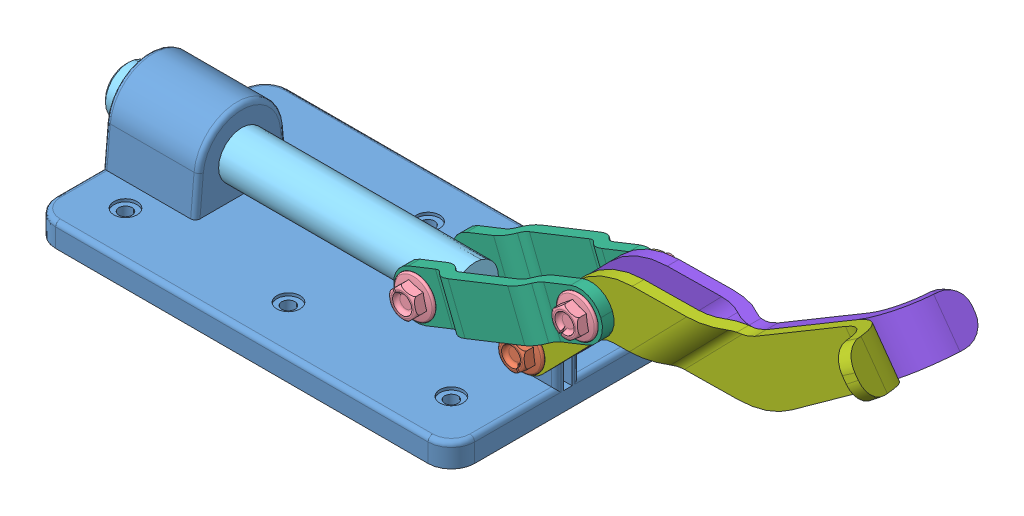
SolidWorks assembly plunger.sldasm, configuration MaxRange (file format 12000). Lengths in mm.
Overall size (219.76 113.92 63.5).
12 component instances, 8 part files, 27 mates.
Components (placement in the parent):
- base_plunger-1: base_plunger.sldprt [Default] at origin
- short bolt_plunger-1: short bolt_plunger.sldprt [Default] at (109.22 15.24 6.35) x (0.598617 -0.801035 0) z (0 0 1)
- nut_plunger-1: nut_plunger.sldprt [Default] at (109.22 15.24 -6.35) x (-0.923728 -0.383049 0) z (0 0 -1)
- long bolt_plunger-1: long bolt_plunger.sldprt [Default] at (126.9419 33.436 9.525) x (-0.358847 -0.933396 0) z (0 0 1)
- nut_plunger-2: nut_plunger.sldprt [Default] at (126.9419 33.436 -9.525) x (0.937093 -0.349079 0) z (0 0 -1)
- long bolt_plunger-2: long bolt_plunger.sldprt [Default] at (82.6728 15.875 9.525) x (-0.700643 0.713512 0) z (0 0 1)
- nut_plunger-3: nut_plunger.sldprt [Default] at (82.6728 15.875 -9.525) x (-0.077903 -0.996961 0) z (0 0 -1)
- plunger-1: plunger.sldprt [Default] at (-6.2272 15.875 0)
- link_plunger-1: link_plunger.sldprt [Default] at (104.8074 24.6555 6.35) x (0.929535 0.368734 0) z (0 0 1)
- link_plunger-2: link_plunger.sldprt [Default] at (104.8074 24.6555 -6.35) x (0.929535 0.368734 0) z (0 0 -1)
- arm left-1: arm left.sldprt [Default] at (109.22 15.24 3.175) x (-0.697714 -0.716376 0) z (0 0 1)
- arm right-1: arm right.sldprt [Default] at (109.22 15.24 -3.175) x (-0.697714 -0.716376 0) z (0 0 1)
Mates (geometry in assembly coordinates):
- Concentric1: concentric aligned: cylinder of base_plunger-1 through (109.22 15.24 3.175) axis (0 0 1) radius 2.54; cylinder of short bolt_plunger-1 through (109.22 15.24 -13.65) axis (0 0 1) radius 2
- Coincident1: coincident anti-aligned: plane of base_plunger-1 through (109.22 15.24 3.175) normal (0 0 1); plane of arm left-1 through (244.6002 5.9931 3.175) normal (0 0 -1)
- Concentric2: concentric anti-aligned: cylinder of arm right-1 through (109.22 15.24 0) axis (0 0 -1) radius 2.3813; cylinder of short bolt_plunger-1 through (109.22 15.24 -13.65) axis (0 0 1) radius 2
- Coincident2: coincident anti-aligned: plane of base_plunger-1 through (109.22 15.24 -3.175) normal (0 0 -1); plane of arm right-1 through (244.6002 5.9931 -3.175) normal (0 0 1)
- Coincident4: coincident anti-aligned: plane of link_plunger-1 through (90.1808 22.1952 6.35) normal (0 0 -1); plane of arm left-1 through (109.22 15.24 6.35) normal (0 0 1)
- Coincident5: coincident anti-aligned: plane of arm right-1 through (109.22 15.24 -6.35) normal (0 0 -1); plane of link_plunger-2 through (90.1738 9.4952 -6.35) normal (0 0 1)
- Concentric4: concentric anti-aligned: cylinder of link_plunger-2 through (83.8273 15.8487 -6.35) axis (0 0 -1) radius 2.3813; cylinder of long bolt_plunger-1 through (83.8273 15.8487 -15.475) axis (0 0 1) radius 2
- Concentric5: concentric aligned: cylinder of link_plunger-1 through (36.2023 15.875 6.35) axis (0 0 1) radius 2.3813; cylinder of long bolt_plunger-2 through (36.2023 15.875 -15.475) axis (0 0 1) radius 2
- Concentric6: concentric anti-aligned: cylinder of base_plunger-1 through (25.4 15.875 0) axis (1 0 0) radius 6.35; cylinder of plunger-1 through (42.5523 15.875 0) axis (-1 0 0) radius 6.35
- Concentric7: concentric aligned: cylinder of plunger-1 through (36.2023 15.875 -6.35) axis (0 0 1) radius 2.3813; cylinder of long bolt_plunger-2 through (36.2023 15.875 -15.475) axis (0 0 1) radius 2
- Concentric8: concentric aligned: cylinder of long bolt_plunger-1 through (83.8273 15.8487 -15.475) axis (0 0 1) radius 2; cylinder of link_plunger-1 through (83.8273 15.8487 6.35) axis (0 0 1) radius 2.3813
- Concentric9: concentric anti-aligned: cylinder of long bolt_plunger-1 through (83.8273 15.8487 -15.475) axis (0 0 1) radius 2; cylinder of nut_plunger-2 through (83.8273 15.8487 -9.525) axis (0 0 -1) radius 2.04
- Concentric10: concentric aligned: cylinder of long bolt_plunger-2 through (36.2023 15.875 -15.475) axis (0 0 1) radius 2; cylinder of link_plunger-1 through (36.2023 15.875 6.35) axis (0 0 1) radius 2.3813
- Concentric11: concentric anti-aligned: cylinder of long bolt_plunger-2 through (36.2023 15.875 -15.475) axis (0 0 1) radius 2; cylinder of nut_plunger-3 through (36.2023 15.875 -9.525) axis (0 0 -1) radius 2.04
- Coincident6: coincident anti-aligned: plane of nut_plunger-2 through (82.4165 12.0615 -9.525) normal (0 0 1); plane of link_plunger-2 through (90.1738 9.4952 -9.525) normal (0 0 -1)
- Coincident7: coincident anti-aligned: plane of long bolt_plunger-1 through (87.5996 14.3984 9.525) normal (0 0 -1); plane of link_plunger-1 through (90.1808 22.1952 9.525) normal (0 0 1)
- Coincident8: coincident anti-aligned: plane of nut_plunger-3 through (32.1731 16.1898 -9.525) normal (0 0 1); plane of link_plunger-2 through (29.8488 9.5285 -9.525) normal (0 0 -1)
- Coincident9: coincident anti-aligned: plane of long bolt_plunger-2 through (33.3187 13.0434 9.525) normal (0 0 -1); plane of link_plunger-1 through (29.8558 22.2285 9.525) normal (0 0 1)
- Concentric12: concentric aligned: cylinder of short bolt_plunger-1 through (109.22 15.24 -13.65) axis (0 0 1) radius 2; cylinder of arm left-1 through (109.22 15.24 0) axis (0 0 1) radius 2.3813
- Coincident10: coincident anti-aligned: plane of short bolt_plunger-1 through (112.4573 17.6593 6.35) normal (0 0 -1); plane of arm left-1 through (109.22 15.24 6.35) normal (0 0 1)
- Concentric13: concentric anti-aligned: cylinder of short bolt_plunger-1 through (109.22 15.24 -13.65) axis (0 0 1) radius 2; cylinder of nut_plunger-1 through (109.22 15.24 -6.35) axis (0 0 -1) radius 2.04
- Coincident11: coincident anti-aligned: plane of nut_plunger-1 through (107.6719 18.9732 -6.35) normal (0 0 1); plane of arm right-1 through (109.22 15.24 -6.35) normal (0 0 -1)
- Concentric14: concentric aligned: cylinder of long bolt_plunger-1 through (83.8273 15.8487 -15.475) axis (0 0 1) radius 2; cylinder of arm left-1 through (83.8273 15.8487 0) axis (0 0 1) radius 2.3813
- Coincident12: coincident: plane of arm left-1 through (109.22 15.24 0) normal (0 0 -1); plane of arm right-1 through (109.22 15.24 0) normal (0 0 1)
- Concentric15: concentric anti-aligned: cylinder of long bolt_plunger-2 through (36.2023 15.875 -15.475) axis (0 0 1) radius 2; cylinder of link_plunger-2 through (36.2023 15.875 -6.35) axis (0 0 -1) radius 2.3813
- Concentric16: concentric anti-aligned: cylinder of long bolt_plunger-1 through (83.8273 15.8487 -15.475) axis (0 0 1) radius 2; cylinder of arm right-1 through (83.8273 15.8487 0) axis (0 0 -1) radius 2.3813
- Perpendicular1: perpendicular: plane of base_plunger-1 through (0 0 31.75) normal (0 -1 0); plane of arm left-1 through (113.5183 11.0537 6.35) normal (0.716376 -0.697714 0)
